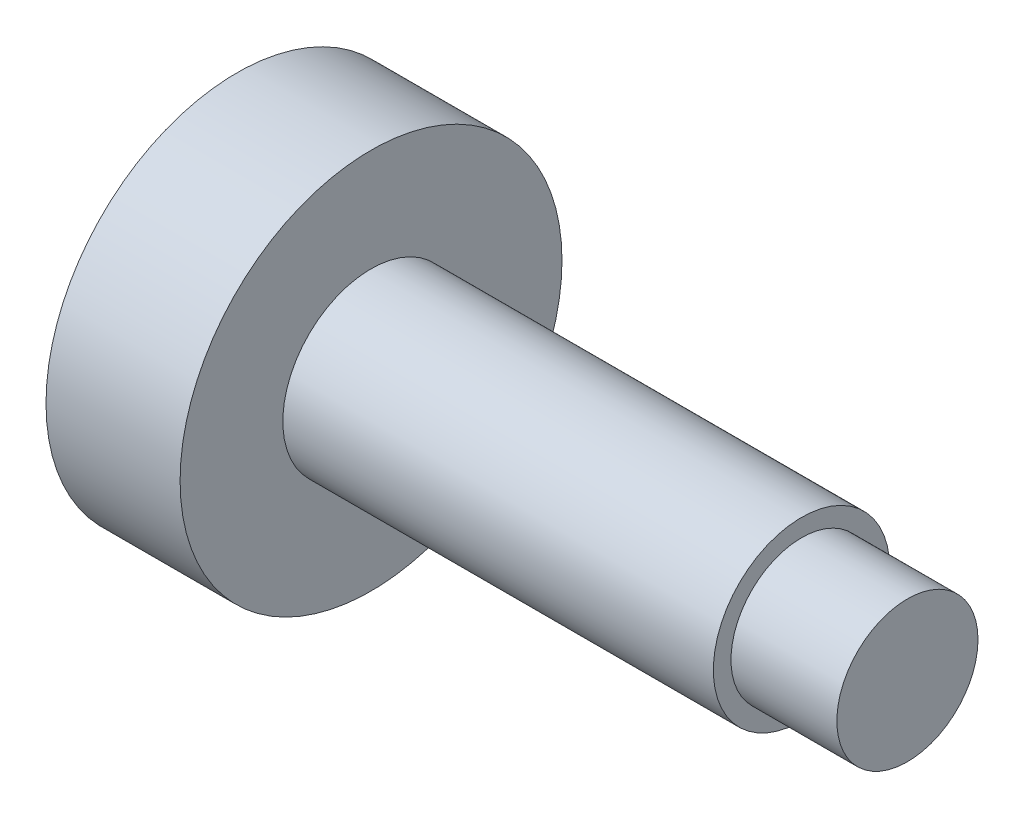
ISO-10303-21;
HEADER;
FILE_DESCRIPTION(('STEP AP214'),'2;1');
FILE_NAME('part.step','',(''),(''),'','','');
FILE_SCHEMA(('AUTOMOTIVE_DESIGN { 1 0 10303 214 1 1 1 1 }'));
ENDSEC;
DATA;
#1=APPLICATION_CONTEXT('core data for automotive mechanical design processes');
#2=APPLICATION_PROTOCOL_DEFINITION('international standard','automotive_design',2000,#1);
#3=PRODUCT_CONTEXT('',#1,'mechanical');
#4=PRODUCT('Part','Part','',(#3));
#5=PRODUCT_RELATED_PRODUCT_CATEGORY('part','',(#4));
#6=PRODUCT_DEFINITION_FORMATION('','',#4);
#7=PRODUCT_DEFINITION_CONTEXT('part definition',#1,'design');
#8=PRODUCT_DEFINITION('design','',#6,#7);
#9=PRODUCT_DEFINITION_SHAPE('','',#8);
#10=(LENGTH_UNIT() NAMED_UNIT(*) SI_UNIT(.MILLI.,.METRE.));
#11=(NAMED_UNIT(*) PLANE_ANGLE_UNIT() SI_UNIT($,.RADIAN.));
#12=(NAMED_UNIT(*) SI_UNIT($,.STERADIAN.) SOLID_ANGLE_UNIT());
#13=UNCERTAINTY_MEASURE_WITH_UNIT(LENGTH_MEASURE(1.E-05),#10,'distance_accuracy_value','');
#14=(GEOMETRIC_REPRESENTATION_CONTEXT(3) GLOBAL_UNCERTAINTY_ASSIGNED_CONTEXT((#13)) GLOBAL_UNIT_ASSIGNED_CONTEXT((#10,
#11,#12)) REPRESENTATION_CONTEXT('',''));
#15=CARTESIAN_POINT('',(0.,0.,0.));
#16=DIRECTION('',(0.,0.,1.));
#17=DIRECTION('',(1.,0.,0.));
#18=AXIS2_PLACEMENT_3D('',#15,#16,#17);
#19=CARTESIAN_POINT('',(-35.,0.,0.));
#20=DIRECTION('',(-1.,0.,0.));
#21=DIRECTION('',(0.,0.,1.));
#22=AXIS2_PLACEMENT_3D('',#19,#20,#21);
#23=PLANE('',#22);
#24=CARTESIAN_POINT('',(-35.,21.,1.));
#25=DIRECTION('',(-1.,0.,0.));
#26=DIRECTION('',(0.,0.,-1.));
#27=AXIS2_PLACEMENT_3D('',#24,#25,#26);
#28=CIRCLE('',#27,2.);
#29=CARTESIAN_POINT('',(-35.,21.,3.));
#30=VERTEX_POINT('',#29);
#31=CARTESIAN_POINT('',(-35.,23.,1.));
#32=VERTEX_POINT('',#31);
#33=EDGE_CURVE('E47',#30,#32,#28,.T.);
#34=ORIENTED_EDGE('',*,*,#33,.F.);
#35=DIRECTION('',(0.,1.,0.));
#36=VECTOR('',#35,1.);
#37=CARTESIAN_POINT('',(-35.,21.,3.));
#38=LINE('',#37,#36);
#39=CARTESIAN_POINT('',(-35.,5.,3.));
#40=VERTEX_POINT('',#39);
#41=EDGE_CURVE('E134',#40,#30,#38,.T.);
#42=ORIENTED_EDGE('',*,*,#41,.F.);
#43=CARTESIAN_POINT('',(-35.,5.,1.));
#44=DIRECTION('',(-1.,0.,0.));
#45=DIRECTION('',(0.,0.,-1.));
#46=AXIS2_PLACEMENT_3D('',#43,#44,#45);
#47=CIRCLE('',#46,2.);
#48=CARTESIAN_POINT('',(-35.,3.,1.));
#49=VERTEX_POINT('',#48);
#50=EDGE_CURVE('E131',#49,#40,#47,.T.);
#51=ORIENTED_EDGE('',*,*,#50,.F.);
#52=DIRECTION('',(0.,0.,1.));
#53=VECTOR('',#52,1.);
#54=CARTESIAN_POINT('',(-35.,3.,-1.));
#55=LINE('',#54,#53);
#56=CARTESIAN_POINT('',(-35.,3.,-1.));
#57=VERTEX_POINT('',#56);
#58=EDGE_CURVE('E128',#57,#49,#55,.T.);
#59=ORIENTED_EDGE('',*,*,#58,.F.);
#60=CARTESIAN_POINT('',(-35.,5.,-1.));
#61=DIRECTION('',(-1.,0.,0.));
#62=DIRECTION('',(0.,0.,-1.));
#63=AXIS2_PLACEMENT_3D('',#60,#61,#62);
#64=CIRCLE('',#63,2.);
#65=CARTESIAN_POINT('',(-35.,5.,-3.));
#66=VERTEX_POINT('',#65);
#67=EDGE_CURVE('E122',#66,#57,#64,.T.);
#68=ORIENTED_EDGE('',*,*,#67,.F.);
#69=DIRECTION('',(0.,-1.,0.));
#70=VECTOR('',#69,1.);
#71=CARTESIAN_POINT('',(-35.,21.,-3.));
#72=LINE('',#71,#70);
#73=CARTESIAN_POINT('',(-35.,21.,-3.));
#74=VERTEX_POINT('',#73);
#75=EDGE_CURVE('E120',#74,#66,#72,.T.);
#76=ORIENTED_EDGE('',*,*,#75,.F.);
#77=CARTESIAN_POINT('',(-35.,21.,-1.));
#78=DIRECTION('',(-1.,0.,0.));
#79=DIRECTION('',(0.,0.,-1.));
#80=AXIS2_PLACEMENT_3D('',#77,#78,#79);
#81=CIRCLE('',#80,2.);
#82=CARTESIAN_POINT('',(-35.,23.,-1.));
#83=VERTEX_POINT('',#82);
#84=EDGE_CURVE('E102',#83,#74,#81,.T.);
#85=ORIENTED_EDGE('',*,*,#84,.F.);
#86=DIRECTION('',(0.,0.,-1.));
#87=VECTOR('',#86,1.);
#88=CARTESIAN_POINT('',(-35.,23.,-1.));
#89=LINE('',#88,#87);
#90=EDGE_CURVE('E113',#32,#83,#89,.T.);
#91=ORIENTED_EDGE('',*,*,#90,.F.);
#92=EDGE_LOOP('',(#34,#42,#51,#59,#68,#76,#85,#91));
#93=FACE_BOUND('',#92,.T.);
#94=CARTESIAN_POINT('',(-35.,0.,0.));
#95=DIRECTION('',(1.,0.,0.));
#96=DIRECTION('',(0.,0.,-1.));
#97=AXIS2_PLACEMENT_3D('',#94,#95,#96);
#98=CIRCLE('',#97,27.055);
#99=CARTESIAN_POINT('',(-35.,0.,-27.055));
#100=VERTEX_POINT('',#99);
#101=EDGE_CURVE('E11',#100,#100,#98,.T.);
#102=ORIENTED_EDGE('',*,*,#101,.F.);
#103=EDGE_LOOP('',(#102));
#104=FACE_BOUND('',#103,.T.);
#105=ADVANCED_FACE('F33',(#93,#104),#23,.T.);
#106=CARTESIAN_POINT('',(0.,0.,0.));
#107=DIRECTION('',(1.,0.,0.));
#108=DIRECTION('',(0.,0.,-1.));
#109=AXIS2_PLACEMENT_3D('',#106,#107,#108);
#110=CYLINDRICAL_SURFACE('',#109,27.055);
#111=ORIENTED_EDGE('',*,*,#101,.T.);
#112=EDGE_LOOP('',(#111));
#113=FACE_BOUND('',#112,.T.);
#114=CARTESIAN_POINT('',(-16.,0.,0.));
#115=DIRECTION('',(1.,0.,0.));
#116=DIRECTION('',(0.,0.,-1.));
#117=AXIS2_PLACEMENT_3D('',#114,#115,#116);
#118=CIRCLE('',#117,27.055);
#119=CARTESIAN_POINT('',(-16.,0.,-27.055));
#120=VERTEX_POINT('',#119);
#121=EDGE_CURVE('E40',#120,#120,#118,.T.);
#122=ORIENTED_EDGE('',*,*,#121,.F.);
#123=EDGE_LOOP('',(#122));
#124=FACE_BOUND('',#123,.T.);
#125=ADVANCED_FACE('F185',(#113,#124),#110,.T.);
#126=CARTESIAN_POINT('',(-16.,12.5,0.));
#127=DIRECTION('',(1.,0.,0.));
#128=DIRECTION('',(0.,0.,-1.));
#129=AXIS2_PLACEMENT_3D('',#126,#127,#128);
#130=PLANE('',#129);
#131=ORIENTED_EDGE('',*,*,#121,.T.);
#132=EDGE_LOOP('',(#131));
#133=FACE_BOUND('',#132,.T.);
#134=CARTESIAN_POINT('',(-16.,0.,0.));
#135=DIRECTION('',(1.,0.,0.));
#136=DIRECTION('',(0.,0.,-1.));
#137=AXIS2_PLACEMENT_3D('',#134,#135,#136);
#138=CIRCLE('',#137,12.5);
#139=CARTESIAN_POINT('',(-16.,0.,-12.5));
#140=VERTEX_POINT('',#139);
#141=EDGE_CURVE('E177',#140,#140,#138,.T.);
#142=ORIENTED_EDGE('',*,*,#141,.F.);
#143=EDGE_LOOP('',(#142));
#144=FACE_BOUND('',#143,.T.);
#145=ADVANCED_FACE('F182',(#133,#144),#130,.T.);
#146=CARTESIAN_POINT('',(0.,0.,0.));
#147=DIRECTION('',(1.,0.,0.));
#148=DIRECTION('',(0.,0.,-1.));
#149=AXIS2_PLACEMENT_3D('',#146,#147,#148);
#150=CYLINDRICAL_SURFACE('',#149,12.5);
#151=ORIENTED_EDGE('',*,*,#141,.T.);
#152=EDGE_LOOP('',(#151));
#153=FACE_BOUND('',#152,.T.);
#154=CARTESIAN_POINT('',(45.,0.,0.));
#155=DIRECTION('',(1.,0.,0.));
#156=DIRECTION('',(0.,0.,-1.));
#157=AXIS2_PLACEMENT_3D('',#154,#155,#156);
#158=CIRCLE('',#157,12.5);
#159=CARTESIAN_POINT('',(45.,0.,-12.5));
#160=VERTEX_POINT('',#159);
#161=EDGE_CURVE('E174',#160,#160,#158,.T.);
#162=ORIENTED_EDGE('',*,*,#161,.F.);
#163=EDGE_LOOP('',(#162));
#164=FACE_BOUND('',#163,.T.);
#165=ADVANCED_FACE('F192',(#153,#164),#150,.T.);
#166=CARTESIAN_POINT('',(45.,10.,0.));
#167=DIRECTION('',(1.,0.,0.));
#168=DIRECTION('',(0.,0.,-1.));
#169=AXIS2_PLACEMENT_3D('',#166,#167,#168);
#170=PLANE('',#169);
#171=ORIENTED_EDGE('',*,*,#161,.T.);
#172=EDGE_LOOP('',(#171));
#173=FACE_BOUND('',#172,.T.);
#174=CARTESIAN_POINT('',(45.,0.,0.));
#175=DIRECTION('',(1.,0.,0.));
#176=DIRECTION('',(0.,0.,-1.));
#177=AXIS2_PLACEMENT_3D('',#174,#175,#176);
#178=CIRCLE('',#177,10.);
#179=CARTESIAN_POINT('',(45.,0.,-10.));
#180=VERTEX_POINT('',#179);
#181=EDGE_CURVE('E171',#180,#180,#178,.T.);
#182=ORIENTED_EDGE('',*,*,#181,.F.);
#183=EDGE_LOOP('',(#182));
#184=FACE_BOUND('',#183,.T.);
#185=ADVANCED_FACE('F197',(#173,#184),#170,.T.);
#186=CARTESIAN_POINT('',(0.,0.,0.));
#187=DIRECTION('',(1.,0.,0.));
#188=DIRECTION('',(0.,0.,-1.));
#189=AXIS2_PLACEMENT_3D('',#186,#187,#188);
#190=CYLINDRICAL_SURFACE('',#189,10.);
#191=ORIENTED_EDGE('',*,*,#181,.T.);
#192=EDGE_LOOP('',(#191));
#193=FACE_BOUND('',#192,.T.);
#194=CARTESIAN_POINT('',(60.,0.,0.));
#195=DIRECTION('',(1.,0.,0.));
#196=DIRECTION('',(0.,0.,-1.));
#197=AXIS2_PLACEMENT_3D('',#194,#195,#196);
#198=CIRCLE('',#197,10.);
#199=CARTESIAN_POINT('',(60.,0.,-10.));
#200=VERTEX_POINT('',#199);
#201=EDGE_CURVE('E158',#200,#200,#198,.T.);
#202=ORIENTED_EDGE('',*,*,#201,.F.);
#203=EDGE_LOOP('',(#202));
#204=FACE_BOUND('',#203,.T.);
#205=ADVANCED_FACE('F201',(#193,#204),#190,.T.);
#206=CARTESIAN_POINT('',(60.,10.,0.));
#207=DIRECTION('',(1.,0.,0.));
#208=DIRECTION('',(0.,0.,-1.));
#209=AXIS2_PLACEMENT_3D('',#206,#207,#208);
#210=PLANE('',#209);
#211=ORIENTED_EDGE('',*,*,#201,.T.);
#212=EDGE_LOOP('',(#211));
#213=FACE_BOUND('',#212,.T.);
#214=ADVANCED_FACE('F205',(#213),#210,.T.);
#215=CARTESIAN_POINT('',(-32.,21.,1.));
#216=DIRECTION('',(-1.,0.,0.));
#217=DIRECTION('',(0.,0.,1.));
#218=AXIS2_PLACEMENT_3D('',#215,#216,#217);
#219=CYLINDRICAL_SURFACE('',#218,2.);
#220=ORIENTED_EDGE('',*,*,#33,.T.);
#221=DIRECTION('',(-1.,0.,0.));
#222=VECTOR('',#221,1.);
#223=CARTESIAN_POINT('',(-32.,23.,1.));
#224=LINE('',#223,#222);
#225=CARTESIAN_POINT('',(-32.,23.,1.));
#226=VERTEX_POINT('',#225);
#227=EDGE_CURVE('E110',#226,#32,#224,.T.);
#228=ORIENTED_EDGE('',*,*,#227,.F.);
#229=CARTESIAN_POINT('',(-32.,21.,1.));
#230=DIRECTION('',(-1.,0.,0.));
#231=DIRECTION('',(0.,0.,-1.));
#232=AXIS2_PLACEMENT_3D('',#229,#230,#231);
#233=CIRCLE('',#232,2.);
#234=CARTESIAN_POINT('',(-32.,21.,3.));
#235=VERTEX_POINT('',#234);
#236=EDGE_CURVE('E136',#235,#226,#233,.T.);
#237=ORIENTED_EDGE('',*,*,#236,.F.);
#238=DIRECTION('',(-1.,0.,0.));
#239=VECTOR('',#238,1.);
#240=CARTESIAN_POINT('',(-32.,21.,3.));
#241=LINE('',#240,#239);
#242=EDGE_CURVE('E54',#235,#30,#241,.T.);
#243=ORIENTED_EDGE('',*,*,#242,.T.);
#244=EDGE_LOOP('',(#220,#228,#237,#243));
#245=FACE_BOUND('',#244,.T.);
#246=ADVANCED_FACE('F209',(#245),#219,.F.);
#247=CARTESIAN_POINT('',(-32.,21.,3.));
#248=DIRECTION('',(0.,0.,1.));
#249=DIRECTION('',(0.,-1.,0.));
#250=AXIS2_PLACEMENT_3D('',#247,#248,#249);
#251=PLANE('',#250);
#252=ORIENTED_EDGE('',*,*,#41,.T.);
#253=ORIENTED_EDGE('',*,*,#242,.F.);
#254=DIRECTION('',(0.,1.,0.));
#255=VECTOR('',#254,1.);
#256=CARTESIAN_POINT('',(-32.,21.,3.));
#257=LINE('',#256,#255);
#258=CARTESIAN_POINT('',(-32.,5.,3.));
#259=VERTEX_POINT('',#258);
#260=EDGE_CURVE('E154',#259,#235,#257,.T.);
#261=ORIENTED_EDGE('',*,*,#260,.F.);
#262=DIRECTION('',(-1.,0.,0.));
#263=VECTOR('',#262,1.);
#264=CARTESIAN_POINT('',(-32.,5.,3.));
#265=LINE('',#264,#263);
#266=EDGE_CURVE('E159',#259,#40,#265,.T.);
#267=ORIENTED_EDGE('',*,*,#266,.T.);
#268=EDGE_LOOP('',(#252,#253,#261,#267));
#269=FACE_BOUND('',#268,.T.);
#270=ADVANCED_FACE('F213',(#269),#251,.F.);
#271=CARTESIAN_POINT('',(-32.,5.,1.));
#272=DIRECTION('',(-1.,0.,0.));
#273=DIRECTION('',(0.,0.,1.));
#274=AXIS2_PLACEMENT_3D('',#271,#272,#273);
#275=CYLINDRICAL_SURFACE('',#274,2.);
#276=ORIENTED_EDGE('',*,*,#50,.T.);
#277=ORIENTED_EDGE('',*,*,#266,.F.);
#278=CARTESIAN_POINT('',(-32.,5.,1.));
#279=DIRECTION('',(-1.,0.,0.));
#280=DIRECTION('',(0.,0.,-1.));
#281=AXIS2_PLACEMENT_3D('',#278,#279,#280);
#282=CIRCLE('',#281,2.);
#283=CARTESIAN_POINT('',(-32.,3.,1.));
#284=VERTEX_POINT('',#283);
#285=EDGE_CURVE('E151',#284,#259,#282,.T.);
#286=ORIENTED_EDGE('',*,*,#285,.F.);
#287=DIRECTION('',(-1.,0.,0.));
#288=VECTOR('',#287,1.);
#289=CARTESIAN_POINT('',(-32.,3.,1.));
#290=LINE('',#289,#288);
#291=EDGE_CURVE('E161',#284,#49,#290,.T.);
#292=ORIENTED_EDGE('',*,*,#291,.T.);
#293=EDGE_LOOP('',(#276,#277,#286,#292));
#294=FACE_BOUND('',#293,.T.);
#295=ADVANCED_FACE('F230',(#294),#275,.F.);
#296=CARTESIAN_POINT('',(-32.,3.,-1.));
#297=DIRECTION('',(0.,-1.,0.));
#298=DIRECTION('',(0.,0.,-1.));
#299=AXIS2_PLACEMENT_3D('',#296,#297,#298);
#300=PLANE('',#299);
#301=ORIENTED_EDGE('',*,*,#58,.T.);
#302=ORIENTED_EDGE('',*,*,#291,.F.);
#303=DIRECTION('',(0.,0.,1.));
#304=VECTOR('',#303,1.);
#305=CARTESIAN_POINT('',(-32.,3.,-1.));
#306=LINE('',#305,#304);
#307=CARTESIAN_POINT('',(-32.,3.,-1.));
#308=VERTEX_POINT('',#307);
#309=EDGE_CURVE('E148',#308,#284,#306,.T.);
#310=ORIENTED_EDGE('',*,*,#309,.F.);
#311=DIRECTION('',(-1.,0.,0.));
#312=VECTOR('',#311,1.);
#313=CARTESIAN_POINT('',(-32.,3.,-1.));
#314=LINE('',#313,#312);
#315=EDGE_CURVE('E163',#308,#57,#314,.T.);
#316=ORIENTED_EDGE('',*,*,#315,.T.);
#317=EDGE_LOOP('',(#301,#302,#310,#316));
#318=FACE_BOUND('',#317,.T.);
#319=ADVANCED_FACE('F226',(#318),#300,.F.);
#320=CARTESIAN_POINT('',(-32.,5.,-1.));
#321=DIRECTION('',(-1.,0.,0.));
#322=DIRECTION('',(0.,0.,1.));
#323=AXIS2_PLACEMENT_3D('',#320,#321,#322);
#324=CYLINDRICAL_SURFACE('',#323,2.);
#325=ORIENTED_EDGE('',*,*,#67,.T.);
#326=ORIENTED_EDGE('',*,*,#315,.F.);
#327=CARTESIAN_POINT('',(-32.,5.,-1.));
#328=DIRECTION('',(-1.,0.,0.));
#329=DIRECTION('',(0.,0.,-1.));
#330=AXIS2_PLACEMENT_3D('',#327,#328,#329);
#331=CIRCLE('',#330,2.);
#332=CARTESIAN_POINT('',(-32.,5.,-3.));
#333=VERTEX_POINT('',#332);
#334=EDGE_CURVE('E145',#333,#308,#331,.T.);
#335=ORIENTED_EDGE('',*,*,#334,.F.);
#336=DIRECTION('',(-1.,0.,0.));
#337=VECTOR('',#336,1.);
#338=CARTESIAN_POINT('',(-32.,5.,-3.));
#339=LINE('',#338,#337);
#340=EDGE_CURVE('E165',#333,#66,#339,.T.);
#341=ORIENTED_EDGE('',*,*,#340,.T.);
#342=EDGE_LOOP('',(#325,#326,#335,#341));
#343=FACE_BOUND('',#342,.T.);
#344=ADVANCED_FACE('F222',(#343),#324,.F.);
#345=CARTESIAN_POINT('',(-32.,21.,-3.));
#346=DIRECTION('',(0.,0.,-1.));
#347=DIRECTION('',(0.,1.,0.));
#348=AXIS2_PLACEMENT_3D('',#345,#346,#347);
#349=PLANE('',#348);
#350=ORIENTED_EDGE('',*,*,#75,.T.);
#351=ORIENTED_EDGE('',*,*,#340,.F.);
#352=DIRECTION('',(0.,-1.,0.));
#353=VECTOR('',#352,1.);
#354=CARTESIAN_POINT('',(-32.,21.,-3.));
#355=LINE('',#354,#353);
#356=CARTESIAN_POINT('',(-32.,21.,-3.));
#357=VERTEX_POINT('',#356);
#358=EDGE_CURVE('E142',#357,#333,#355,.T.);
#359=ORIENTED_EDGE('',*,*,#358,.F.);
#360=DIRECTION('',(-1.,0.,0.));
#361=VECTOR('',#360,1.);
#362=CARTESIAN_POINT('',(-32.,21.,-3.));
#363=LINE('',#362,#361);
#364=EDGE_CURVE('E109',#357,#74,#363,.T.);
#365=ORIENTED_EDGE('',*,*,#364,.T.);
#366=EDGE_LOOP('',(#350,#351,#359,#365));
#367=FACE_BOUND('',#366,.T.);
#368=ADVANCED_FACE('F219',(#367),#349,.F.);
#369=CARTESIAN_POINT('',(-32.,21.,-1.));
#370=DIRECTION('',(-1.,0.,0.));
#371=DIRECTION('',(0.,0.,1.));
#372=AXIS2_PLACEMENT_3D('',#369,#370,#371);
#373=CYLINDRICAL_SURFACE('',#372,2.);
#374=ORIENTED_EDGE('',*,*,#84,.T.);
#375=ORIENTED_EDGE('',*,*,#364,.F.);
#376=CARTESIAN_POINT('',(-32.,21.,-1.));
#377=DIRECTION('',(-1.,0.,0.));
#378=DIRECTION('',(0.,0.,-1.));
#379=AXIS2_PLACEMENT_3D('',#376,#377,#378);
#380=CIRCLE('',#379,2.);
#381=CARTESIAN_POINT('',(-32.,23.,-1.));
#382=VERTEX_POINT('',#381);
#383=EDGE_CURVE('E105',#382,#357,#380,.T.);
#384=ORIENTED_EDGE('',*,*,#383,.F.);
#385=DIRECTION('',(-1.,0.,0.));
#386=VECTOR('',#385,1.);
#387=CARTESIAN_POINT('',(-32.,23.,-1.));
#388=LINE('',#387,#386);
#389=EDGE_CURVE('E98',#382,#83,#388,.T.);
#390=ORIENTED_EDGE('',*,*,#389,.T.);
#391=EDGE_LOOP('',(#374,#375,#384,#390));
#392=FACE_BOUND('',#391,.T.);
#393=ADVANCED_FACE('F100',(#392),#373,.F.);
#394=CARTESIAN_POINT('',(-32.,23.,-1.));
#395=DIRECTION('',(0.,1.,0.));
#396=DIRECTION('',(0.,0.,1.));
#397=AXIS2_PLACEMENT_3D('',#394,#395,#396);
#398=PLANE('',#397);
#399=ORIENTED_EDGE('',*,*,#90,.T.);
#400=ORIENTED_EDGE('',*,*,#389,.F.);
#401=DIRECTION('',(0.,0.,-1.));
#402=VECTOR('',#401,1.);
#403=CARTESIAN_POINT('',(-32.,23.,-1.));
#404=LINE('',#403,#402);
#405=EDGE_CURVE('E139',#226,#382,#404,.T.);
#406=ORIENTED_EDGE('',*,*,#405,.F.);
#407=ORIENTED_EDGE('',*,*,#227,.T.);
#408=EDGE_LOOP('',(#399,#400,#406,#407));
#409=FACE_BOUND('',#408,.T.);
#410=ADVANCED_FACE('F114',(#409),#398,.F.);
#411=CARTESIAN_POINT('',(-32.,21.,1.));
#412=DIRECTION('',(1.,0.,0.));
#413=DIRECTION('',(0.,0.,-1.));
#414=AXIS2_PLACEMENT_3D('',#411,#412,#413);
#415=PLANE('',#414);
#416=ORIENTED_EDGE('',*,*,#236,.T.);
#417=ORIENTED_EDGE('',*,*,#405,.T.);
#418=ORIENTED_EDGE('',*,*,#383,.T.);
#419=ORIENTED_EDGE('',*,*,#358,.T.);
#420=ORIENTED_EDGE('',*,*,#334,.T.);
#421=ORIENTED_EDGE('',*,*,#309,.T.);
#422=ORIENTED_EDGE('',*,*,#285,.T.);
#423=ORIENTED_EDGE('',*,*,#260,.T.);
#424=EDGE_LOOP('',(#416,#417,#418,#419,#420,#421,#422,#423));
#425=FACE_BOUND('',#424,.T.);
#426=ADVANCED_FACE('F216',(#425),#415,.F.);
#427=CLOSED_SHELL('',(#105,#125,#145,#165,#185,#205,#214,#246,#270,#295,#319,#344,#368,#393,
#410,#426));
#428=MANIFOLD_SOLID_BREP('B2',#427);
#429=ADVANCED_BREP_SHAPE_REPRESENTATION('',(#18,#428),#14);
#430=SHAPE_DEFINITION_REPRESENTATION(#9,#429);
ENDSEC;
END-ISO-10303-21;
